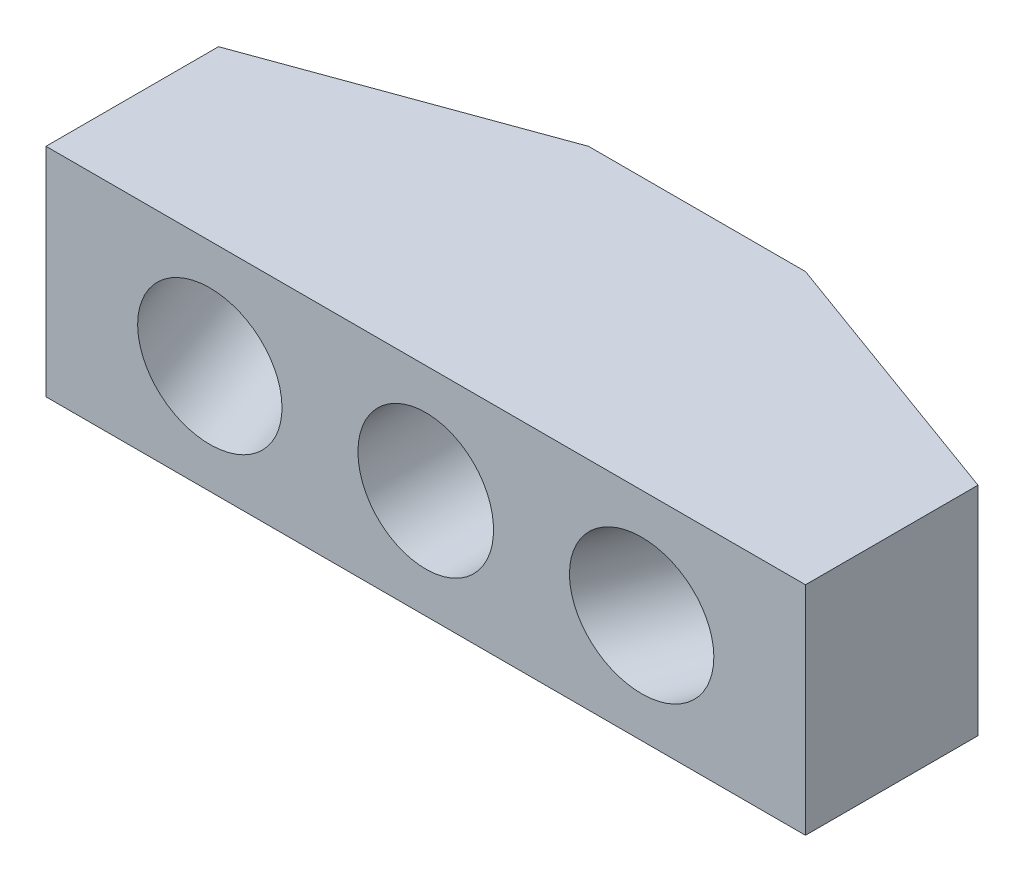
ISO-10303-21;
HEADER;
FILE_DESCRIPTION(('STEP AP214'),'2;1');
FILE_NAME('part.step','',(''),(''),'','','');
FILE_SCHEMA(('AUTOMOTIVE_DESIGN { 1 0 10303 214 1 1 1 1 }'));
ENDSEC;
DATA;
#1=APPLICATION_CONTEXT('core data for automotive mechanical design processes');
#2=APPLICATION_PROTOCOL_DEFINITION('international standard','automotive_design',2000,#1);
#3=PRODUCT_CONTEXT('',#1,'mechanical');
#4=PRODUCT('Part','Part','',(#3));
#5=PRODUCT_RELATED_PRODUCT_CATEGORY('part','',(#4));
#6=PRODUCT_DEFINITION_FORMATION('','',#4);
#7=PRODUCT_DEFINITION_CONTEXT('part definition',#1,'design');
#8=PRODUCT_DEFINITION('design','',#6,#7);
#9=PRODUCT_DEFINITION_SHAPE('','',#8);
#10=(LENGTH_UNIT() NAMED_UNIT(*) SI_UNIT(.MILLI.,.METRE.));
#11=(NAMED_UNIT(*) PLANE_ANGLE_UNIT() SI_UNIT($,.RADIAN.));
#12=(NAMED_UNIT(*) SI_UNIT($,.STERADIAN.) SOLID_ANGLE_UNIT());
#13=UNCERTAINTY_MEASURE_WITH_UNIT(LENGTH_MEASURE(1.E-05),#10,'distance_accuracy_value','');
#14=(GEOMETRIC_REPRESENTATION_CONTEXT(3) GLOBAL_UNCERTAINTY_ASSIGNED_CONTEXT((#13)) GLOBAL_UNIT_ASSIGNED_CONTEXT((#10,
#11,#12)) REPRESENTATION_CONTEXT('',''));
#15=CARTESIAN_POINT('',(0.,0.,0.));
#16=DIRECTION('',(0.,0.,1.));
#17=DIRECTION('',(1.,0.,0.));
#18=AXIS2_PLACEMENT_3D('',#15,#16,#17);
#19=CARTESIAN_POINT('',(14.,4.,-3.01930827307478));
#20=DIRECTION('',(-1.,0.,0.));
#21=DIRECTION('',(0.,0.,1.));
#22=AXIS2_PLACEMENT_3D('',#19,#20,#21);
#23=PLANE('',#22);
#24=DIRECTION('',(0.,0.,-1.));
#25=VECTOR('',#24,1.);
#26=CARTESIAN_POINT('',(14.,-4.,-3.01930827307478));
#27=LINE('',#26,#25);
#28=CARTESIAN_POINT('',(14.,-4.,3.34098938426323));
#29=VERTEX_POINT('',#28);
#30=CARTESIAN_POINT('',(14.,-4.,-3.01930827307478));
#31=VERTEX_POINT('',#30);
#32=EDGE_CURVE('E122',#29,#31,#27,.T.);
#33=ORIENTED_EDGE('',*,*,#32,.T.);
#34=DIRECTION('',(0.,-1.,0.));
#35=VECTOR('',#34,1.);
#36=CARTESIAN_POINT('',(14.,4.,-3.01930827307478));
#37=LINE('',#36,#35);
#38=CARTESIAN_POINT('',(14.,4.,-3.01930827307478));
#39=VERTEX_POINT('',#38);
#40=EDGE_CURVE('E11',#39,#31,#37,.T.);
#41=ORIENTED_EDGE('',*,*,#40,.F.);
#42=DIRECTION('',(0.,0.,-1.));
#43=VECTOR('',#42,1.);
#44=CARTESIAN_POINT('',(14.,4.,-3.01930827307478));
#45=LINE('',#44,#43);
#46=CARTESIAN_POINT('',(14.,4.,3.34098938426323));
#47=VERTEX_POINT('',#46);
#48=EDGE_CURVE('E133',#47,#39,#45,.T.);
#49=ORIENTED_EDGE('',*,*,#48,.F.);
#50=DIRECTION('',(0.,-1.,0.));
#51=VECTOR('',#50,1.);
#52=CARTESIAN_POINT('',(14.,4.,3.34098938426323));
#53=LINE('',#52,#51);
#54=EDGE_CURVE('E118',#47,#29,#53,.T.);
#55=ORIENTED_EDGE('',*,*,#54,.T.);
#56=EDGE_LOOP('',(#33,#41,#49,#55));
#57=FACE_BOUND('',#56,.T.);
#58=ADVANCED_FACE('F36',(#57),#23,.F.);
#59=CARTESIAN_POINT('',(4.,4.,-6.65901061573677));
#60=DIRECTION('',(-0.342020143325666,0.,0.939692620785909));
#61=DIRECTION('',(0.939692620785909,0.,0.342020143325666));
#62=AXIS2_PLACEMENT_3D('',#59,#60,#61);
#63=PLANE('',#62);
#64=CARTESIAN_POINT('',(10.7110758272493,0.,-4.21637877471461));
#65=DIRECTION('',(0.342020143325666,0.,-0.939692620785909));
#66=DIRECTION('',(-0.939692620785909,0.,-0.342020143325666));
#67=AXIS2_PLACEMENT_3D('',#64,#65,#66);
#68=CIRCLE('',#67,2.49999999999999);
#69=CARTESIAN_POINT('',(8.36184427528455,0.,-5.07142913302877));
#70=VERTEX_POINT('',#69);
#71=EDGE_CURVE('E151',#70,#70,#68,.T.);
#72=ORIENTED_EDGE('',*,*,#71,.F.);
#73=EDGE_LOOP('',(#72));
#74=FACE_BOUND('',#73,.T.);
#75=DIRECTION('',(-0.939692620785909,0.,-0.342020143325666));
#76=VECTOR('',#75,1.);
#77=CARTESIAN_POINT('',(4.,-4.,-6.65901061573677));
#78=LINE('',#77,#76);
#79=CARTESIAN_POINT('',(4.,-4.,-6.65901061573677));
#80=VERTEX_POINT('',#79);
#81=EDGE_CURVE('E125',#31,#80,#78,.T.);
#82=ORIENTED_EDGE('',*,*,#81,.T.);
#83=DIRECTION('',(0.,-1.,0.));
#84=VECTOR('',#83,1.);
#85=CARTESIAN_POINT('',(4.,4.,-6.65901061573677));
#86=LINE('',#85,#84);
#87=CARTESIAN_POINT('',(4.,4.,-6.65901061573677));
#88=VERTEX_POINT('',#87);
#89=EDGE_CURVE('E45',#88,#80,#86,.T.);
#90=ORIENTED_EDGE('',*,*,#89,.F.);
#91=DIRECTION('',(-0.939692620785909,0.,-0.342020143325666));
#92=VECTOR('',#91,1.);
#93=CARTESIAN_POINT('',(4.,4.,-6.65901061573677));
#94=LINE('',#93,#92);
#95=EDGE_CURVE('E91',#39,#88,#94,.T.);
#96=ORIENTED_EDGE('',*,*,#95,.F.);
#97=ORIENTED_EDGE('',*,*,#40,.T.);
#98=EDGE_LOOP('',(#82,#90,#96,#97));
#99=FACE_BOUND('',#98,.T.);
#100=ADVANCED_FACE('F159',(#74,#99),#63,.F.);
#101=CARTESIAN_POINT('',(4.,4.,-6.65901061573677));
#102=DIRECTION('',(0.,0.,1.));
#103=DIRECTION('',(1.,0.,0.));
#104=AXIS2_PLACEMENT_3D('',#101,#102,#103);
#105=PLANE('',#104);
#106=CARTESIAN_POINT('',(0.,0.,-6.65901061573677));
#107=DIRECTION('',(0.,0.,-1.));
#108=DIRECTION('',(-1.,0.,0.));
#109=AXIS2_PLACEMENT_3D('',#106,#107,#108);
#110=CIRCLE('',#109,2.5);
#111=CARTESIAN_POINT('',(-2.5,0.,-6.65901061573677));
#112=VERTEX_POINT('',#111);
#113=EDGE_CURVE('E140',#112,#112,#110,.T.);
#114=ORIENTED_EDGE('',*,*,#113,.F.);
#115=EDGE_LOOP('',(#114));
#116=FACE_BOUND('',#115,.T.);
#117=DIRECTION('',(-1.,0.,0.));
#118=VECTOR('',#117,1.);
#119=CARTESIAN_POINT('',(4.,-4.,-6.65901061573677));
#120=LINE('',#119,#118);
#121=CARTESIAN_POINT('',(-4.,-4.,-6.65901061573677));
#122=VERTEX_POINT('',#121);
#123=EDGE_CURVE('E128',#80,#122,#120,.T.);
#124=ORIENTED_EDGE('',*,*,#123,.T.);
#125=DIRECTION('',(0.,-1.,0.));
#126=VECTOR('',#125,1.);
#127=CARTESIAN_POINT('',(-4.,4.,-6.65901061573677));
#128=LINE('',#127,#126);
#129=CARTESIAN_POINT('',(-4.,4.,-6.65901061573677));
#130=VERTEX_POINT('',#129);
#131=EDGE_CURVE('E113',#130,#122,#128,.T.);
#132=ORIENTED_EDGE('',*,*,#131,.F.);
#133=DIRECTION('',(-1.,0.,0.));
#134=VECTOR('',#133,1.);
#135=CARTESIAN_POINT('',(4.,4.,-6.65901061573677));
#136=LINE('',#135,#134);
#137=EDGE_CURVE('E104',#88,#130,#136,.T.);
#138=ORIENTED_EDGE('',*,*,#137,.F.);
#139=ORIENTED_EDGE('',*,*,#89,.T.);
#140=EDGE_LOOP('',(#124,#132,#138,#139));
#141=FACE_BOUND('',#140,.T.);
#142=ADVANCED_FACE('F162',(#116,#141),#105,.F.);
#143=CARTESIAN_POINT('',(-4.,4.,-6.65901061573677));
#144=DIRECTION('',(0.342020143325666,0.,0.939692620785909));
#145=DIRECTION('',(0.939692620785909,0.,-0.342020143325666));
#146=AXIS2_PLACEMENT_3D('',#143,#144,#145);
#147=PLANE('',#146);
#148=CARTESIAN_POINT('',(-10.7110758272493,0.,-4.21637877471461));
#149=DIRECTION('',(-0.342020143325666,0.,-0.939692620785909));
#150=DIRECTION('',(-0.939692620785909,0.,0.342020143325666));
#151=AXIS2_PLACEMENT_3D('',#148,#149,#150);
#152=CIRCLE('',#151,2.49999999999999);
#153=CARTESIAN_POINT('',(-13.0603073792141,0.,-3.36132841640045));
#154=VERTEX_POINT('',#153);
#155=EDGE_CURVE('E141',#154,#154,#152,.T.);
#156=ORIENTED_EDGE('',*,*,#155,.F.);
#157=EDGE_LOOP('',(#156));
#158=FACE_BOUND('',#157,.T.);
#159=DIRECTION('',(-0.939692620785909,0.,0.342020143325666));
#160=VECTOR('',#159,1.);
#161=CARTESIAN_POINT('',(-4.,-4.,-6.65901061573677));
#162=LINE('',#161,#160);
#163=CARTESIAN_POINT('',(-14.,-4.,-3.01930827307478));
#164=VERTEX_POINT('',#163);
#165=EDGE_CURVE('E112',#122,#164,#162,.T.);
#166=ORIENTED_EDGE('',*,*,#165,.T.);
#167=DIRECTION('',(0.,-1.,0.));
#168=VECTOR('',#167,1.);
#169=CARTESIAN_POINT('',(-14.,4.,-3.01930827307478));
#170=LINE('',#169,#168);
#171=CARTESIAN_POINT('',(-14.,4.,-3.01930827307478));
#172=VERTEX_POINT('',#171);
#173=EDGE_CURVE('E109',#172,#164,#170,.T.);
#174=ORIENTED_EDGE('',*,*,#173,.F.);
#175=DIRECTION('',(-0.939692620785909,0.,0.342020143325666));
#176=VECTOR('',#175,1.);
#177=CARTESIAN_POINT('',(-4.,4.,-6.65901061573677));
#178=LINE('',#177,#176);
#179=EDGE_CURVE('E98',#130,#172,#178,.T.);
#180=ORIENTED_EDGE('',*,*,#179,.F.);
#181=ORIENTED_EDGE('',*,*,#131,.T.);
#182=EDGE_LOOP('',(#166,#174,#180,#181));
#183=FACE_BOUND('',#182,.T.);
#184=ADVANCED_FACE('F110',(#158,#183),#147,.F.);
#185=CARTESIAN_POINT('',(-14.,4.,-3.01930827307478));
#186=DIRECTION('',(1.,0.,0.));
#187=DIRECTION('',(0.,0.,-1.));
#188=AXIS2_PLACEMENT_3D('',#185,#186,#187);
#189=PLANE('',#188);
#190=DIRECTION('',(0.,0.,1.));
#191=VECTOR('',#190,1.);
#192=CARTESIAN_POINT('',(-14.,-4.,-3.01930827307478));
#193=LINE('',#192,#191);
#194=CARTESIAN_POINT('',(-14.,-4.,3.34098938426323));
#195=VERTEX_POINT('',#194);
#196=EDGE_CURVE('E77',#164,#195,#193,.T.);
#197=ORIENTED_EDGE('',*,*,#196,.T.);
#198=DIRECTION('',(0.,-1.,0.));
#199=VECTOR('',#198,1.);
#200=CARTESIAN_POINT('',(-14.,4.,3.34098938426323));
#201=LINE('',#200,#199);
#202=CARTESIAN_POINT('',(-14.,4.,3.34098938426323));
#203=VERTEX_POINT('',#202);
#204=EDGE_CURVE('E114',#203,#195,#201,.T.);
#205=ORIENTED_EDGE('',*,*,#204,.F.);
#206=DIRECTION('',(0.,0.,1.));
#207=VECTOR('',#206,1.);
#208=CARTESIAN_POINT('',(-14.,4.,-3.01930827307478));
#209=LINE('',#208,#207);
#210=EDGE_CURVE('E102',#172,#203,#209,.T.);
#211=ORIENTED_EDGE('',*,*,#210,.F.);
#212=ORIENTED_EDGE('',*,*,#173,.T.);
#213=EDGE_LOOP('',(#197,#205,#211,#212));
#214=FACE_BOUND('',#213,.T.);
#215=ADVANCED_FACE('F116',(#214),#189,.F.);
#216=CARTESIAN_POINT('',(-14.,4.,3.34098938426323));
#217=DIRECTION('',(0.,0.,-1.));
#218=DIRECTION('',(-1.,0.,0.));
#219=AXIS2_PLACEMENT_3D('',#216,#217,#218);
#220=PLANE('',#219);
#221=CARTESIAN_POINT('',(7.96041876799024,0.,3.34098938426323));
#222=DIRECTION('',(0.,0.,-1.));
#223=DIRECTION('',(1.,0.,0.));
#224=AXIS2_PLACEMENT_3D('',#221,#222,#223);
#225=ELLIPSE('',#224,2.66044443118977,2.49999999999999);
#226=CARTESIAN_POINT('',(10.62086319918,0.,3.34098938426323));
#227=VERTEX_POINT('',#226);
#228=EDGE_CURVE('E39',#227,#227,#225,.T.);
#229=ORIENTED_EDGE('',*,*,#228,.T.);
#230=EDGE_LOOP('',(#229));
#231=FACE_BOUND('',#230,.T.);
#232=CARTESIAN_POINT('',(-7.96041876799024,0.,3.34098938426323));
#233=DIRECTION('',(0.,0.,-1.));
#234=DIRECTION('',(-1.,0.,0.));
#235=AXIS2_PLACEMENT_3D('',#232,#233,#234);
#236=ELLIPSE('',#235,2.66044443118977,2.49999999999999);
#237=CARTESIAN_POINT('',(-10.62086319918,0.,3.34098938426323));
#238=VERTEX_POINT('',#237);
#239=EDGE_CURVE('E138',#238,#238,#236,.T.);
#240=ORIENTED_EDGE('',*,*,#239,.T.);
#241=EDGE_LOOP('',(#240));
#242=FACE_BOUND('',#241,.T.);
#243=CARTESIAN_POINT('',(0.,0.,3.34098938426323));
#244=DIRECTION('',(0.,0.,-1.));
#245=DIRECTION('',(-1.,0.,0.));
#246=AXIS2_PLACEMENT_3D('',#243,#244,#245);
#247=CIRCLE('',#246,2.5);
#248=CARTESIAN_POINT('',(-2.5,0.,3.34098938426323));
#249=VERTEX_POINT('',#248);
#250=EDGE_CURVE('E126',#249,#249,#247,.T.);
#251=ORIENTED_EDGE('',*,*,#250,.T.);
#252=EDGE_LOOP('',(#251));
#253=FACE_BOUND('',#252,.T.);
#254=DIRECTION('',(1.,0.,0.));
#255=VECTOR('',#254,1.);
#256=CARTESIAN_POINT('',(-14.,-4.,3.34098938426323));
#257=LINE('',#256,#255);
#258=EDGE_CURVE('E83',#195,#29,#257,.T.);
#259=ORIENTED_EDGE('',*,*,#258,.T.);
#260=ORIENTED_EDGE('',*,*,#54,.F.);
#261=DIRECTION('',(1.,0.,0.));
#262=VECTOR('',#261,1.);
#263=CARTESIAN_POINT('',(-14.,4.,3.34098938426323));
#264=LINE('',#263,#262);
#265=EDGE_CURVE('E54',#203,#47,#264,.T.);
#266=ORIENTED_EDGE('',*,*,#265,.F.);
#267=ORIENTED_EDGE('',*,*,#204,.T.);
#268=EDGE_LOOP('',(#259,#260,#266,#267));
#269=FACE_BOUND('',#268,.T.);
#270=ADVANCED_FACE('F167',(#231,#242,#253,#269),#220,.F.);
#271=CARTESIAN_POINT('',(0.,4.,0.));
#272=DIRECTION('',(0.,1.,0.));
#273=DIRECTION('',(0.,0.,1.));
#274=AXIS2_PLACEMENT_3D('',#271,#272,#273);
#275=PLANE('',#274);
#276=ORIENTED_EDGE('',*,*,#48,.T.);
#277=ORIENTED_EDGE('',*,*,#95,.T.);
#278=ORIENTED_EDGE('',*,*,#137,.T.);
#279=ORIENTED_EDGE('',*,*,#179,.T.);
#280=ORIENTED_EDGE('',*,*,#210,.T.);
#281=ORIENTED_EDGE('',*,*,#265,.T.);
#282=EDGE_LOOP('',(#276,#277,#278,#279,#280,#281));
#283=FACE_BOUND('',#282,.T.);
#284=ADVANCED_FACE('F100',(#283),#275,.T.);
#285=CARTESIAN_POINT('',(0.,-4.,0.));
#286=DIRECTION('',(0.,1.,0.));
#287=DIRECTION('',(0.,0.,1.));
#288=AXIS2_PLACEMENT_3D('',#285,#286,#287);
#289=PLANE('',#288);
#290=ORIENTED_EDGE('',*,*,#32,.F.);
#291=ORIENTED_EDGE('',*,*,#258,.F.);
#292=ORIENTED_EDGE('',*,*,#196,.F.);
#293=ORIENTED_EDGE('',*,*,#165,.F.);
#294=ORIENTED_EDGE('',*,*,#123,.F.);
#295=ORIENTED_EDGE('',*,*,#81,.F.);
#296=EDGE_LOOP('',(#290,#291,#292,#293,#294,#295));
#297=FACE_BOUND('',#296,.T.);
#298=ADVANCED_FACE('F165',(#297),#289,.F.);
#299=CARTESIAN_POINT('',(0.,0.,-6.65901061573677));
#300=DIRECTION('',(0.,0.,-1.));
#301=DIRECTION('',(-1.,0.,0.));
#302=AXIS2_PLACEMENT_3D('',#299,#300,#301);
#303=CYLINDRICAL_SURFACE('',#302,2.5);
#304=ORIENTED_EDGE('',*,*,#250,.F.);
#305=EDGE_LOOP('',(#304));
#306=FACE_BOUND('',#305,.T.);
#307=ORIENTED_EDGE('',*,*,#113,.T.);
#308=EDGE_LOOP('',(#307));
#309=FACE_BOUND('',#308,.T.);
#310=ADVANCED_FACE('F219',(#306,#309),#303,.F.);
#311=CARTESIAN_POINT('',(-10.7110758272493,0.,-4.21637877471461));
#312=DIRECTION('',(-0.342020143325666,0.,-0.939692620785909));
#313=DIRECTION('',(-0.939692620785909,0.,0.342020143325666));
#314=AXIS2_PLACEMENT_3D('',#311,#312,#313);
#315=CYLINDRICAL_SURFACE('',#314,2.49999999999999);
#316=ORIENTED_EDGE('',*,*,#155,.T.);
#317=EDGE_LOOP('',(#316));
#318=FACE_BOUND('',#317,.T.);
#319=ORIENTED_EDGE('',*,*,#239,.F.);
#320=EDGE_LOOP('',(#319));
#321=FACE_BOUND('',#320,.T.);
#322=ADVANCED_FACE('F232',(#318,#321),#315,.F.);
#323=CARTESIAN_POINT('',(10.7110758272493,0.,-4.21637877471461));
#324=DIRECTION('',(0.342020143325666,0.,-0.939692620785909));
#325=DIRECTION('',(-0.939692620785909,0.,-0.342020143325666));
#326=AXIS2_PLACEMENT_3D('',#323,#324,#325);
#327=CYLINDRICAL_SURFACE('',#326,2.49999999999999);
#328=ORIENTED_EDGE('',*,*,#71,.T.);
#329=EDGE_LOOP('',(#328));
#330=FACE_BOUND('',#329,.T.);
#331=ORIENTED_EDGE('',*,*,#228,.F.);
#332=EDGE_LOOP('',(#331));
#333=FACE_BOUND('',#332,.T.);
#334=ADVANCED_FACE('F244',(#330,#333),#327,.F.);
#335=CLOSED_SHELL('',(#58,#100,#142,#184,#215,#270,#284,#298,#310,#322,#334));
#336=MANIFOLD_SOLID_BREP('B2',#335);
#337=ADVANCED_BREP_SHAPE_REPRESENTATION('',(#18,#336),#14);
#338=SHAPE_DEFINITION_REPRESENTATION(#9,#337);
ENDSEC;
END-ISO-10303-21;
